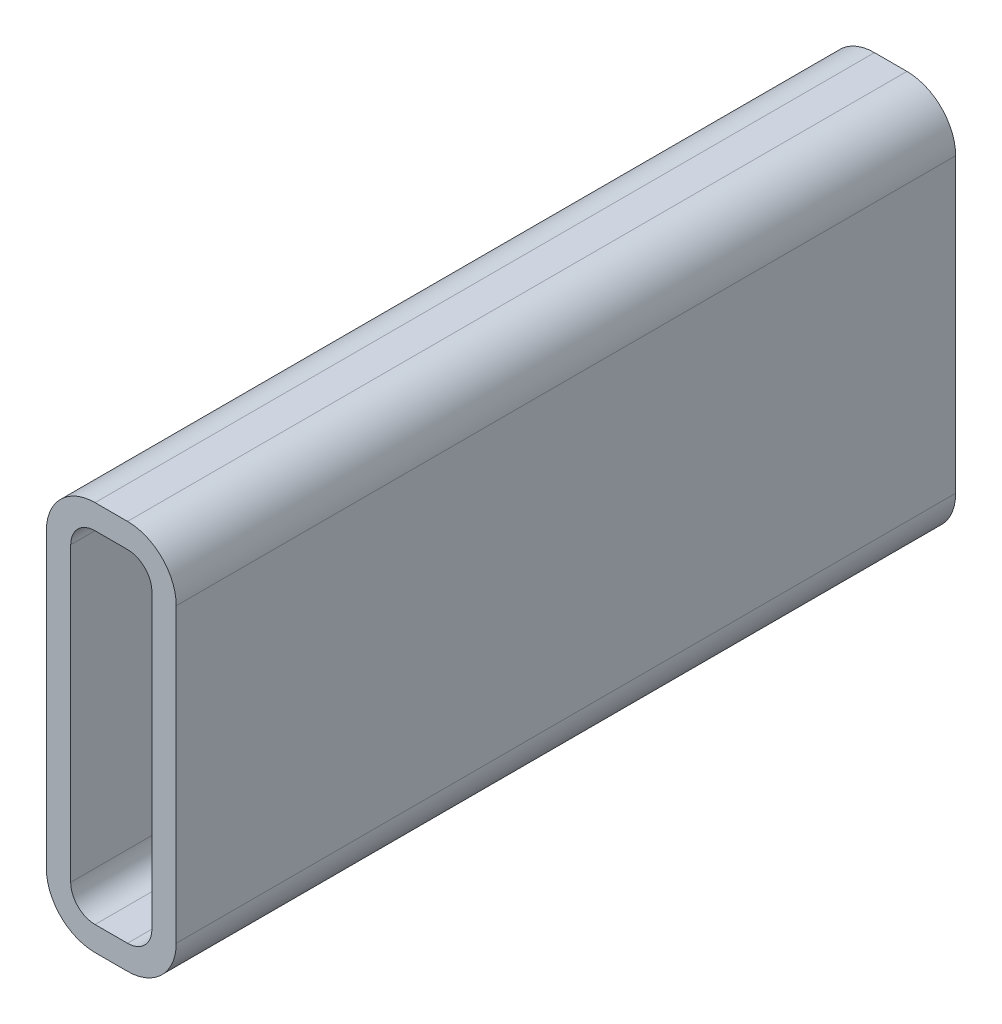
ISO-10303-21;
HEADER;
FILE_DESCRIPTION(('STEP AP214'),'2;1');
FILE_NAME('part.step','',(''),(''),'','','');
FILE_SCHEMA(('AUTOMOTIVE_DESIGN { 1 0 10303 214 1 1 1 1 }'));
ENDSEC;
DATA;
#1=APPLICATION_CONTEXT('core data for automotive mechanical design processes');
#2=APPLICATION_PROTOCOL_DEFINITION('international standard','automotive_design',2000,#1);
#3=PRODUCT_CONTEXT('',#1,'mechanical');
#4=PRODUCT('Part','Part','',(#3));
#5=PRODUCT_RELATED_PRODUCT_CATEGORY('part','',(#4));
#6=PRODUCT_DEFINITION_FORMATION('','',#4);
#7=PRODUCT_DEFINITION_CONTEXT('part definition',#1,'design');
#8=PRODUCT_DEFINITION('design','',#6,#7);
#9=PRODUCT_DEFINITION_SHAPE('','',#8);
#10=(LENGTH_UNIT() NAMED_UNIT(*) SI_UNIT(.MILLI.,.METRE.));
#11=(NAMED_UNIT(*) PLANE_ANGLE_UNIT() SI_UNIT($,.RADIAN.));
#12=(NAMED_UNIT(*) SI_UNIT($,.STERADIAN.) SOLID_ANGLE_UNIT());
#13=UNCERTAINTY_MEASURE_WITH_UNIT(LENGTH_MEASURE(1.E-05),#10,'distance_accuracy_value','');
#14=(GEOMETRIC_REPRESENTATION_CONTEXT(3) GLOBAL_UNCERTAINTY_ASSIGNED_CONTEXT((#13)) GLOBAL_UNIT_ASSIGNED_CONTEXT((#10,
#11,#12)) REPRESENTATION_CONTEXT('',''));
#15=CARTESIAN_POINT('',(0.,0.,0.));
#16=DIRECTION('',(0.,0.,1.));
#17=DIRECTION('',(1.,0.,0.));
#18=AXIS2_PLACEMENT_3D('',#15,#16,#17);
#19=CARTESIAN_POINT('',(19.05,133.35,304.8));
#20=DIRECTION('',(0.,0.,1.));
#21=DIRECTION('',(1.,0.,0.));
#22=AXIS2_PLACEMENT_3D('',#19,#20,#21);
#23=PLANE('',#22);
#24=CARTESIAN_POINT('',(19.05,133.35,304.8));
#25=DIRECTION('',(0.,0.,1.));
#26=DIRECTION('',(1.,0.,0.));
#27=AXIS2_PLACEMENT_3D('',#24,#25,#26);
#28=CIRCLE('',#27,19.05);
#29=CARTESIAN_POINT('',(19.05,152.4,304.8));
#30=VERTEX_POINT('',#29);
#31=CARTESIAN_POINT('',(0.,133.35,304.8));
#32=VERTEX_POINT('',#31);
#33=EDGE_CURVE('E211',#30,#32,#28,.T.);
#34=ORIENTED_EDGE('',*,*,#33,.T.);
#35=DIRECTION('',(0.,-1.,0.));
#36=VECTOR('',#35,1.);
#37=CARTESIAN_POINT('',(0.,19.05,304.8));
#38=LINE('',#37,#36);
#39=CARTESIAN_POINT('',(0.,19.05,304.8));
#40=VERTEX_POINT('',#39);
#41=EDGE_CURVE('E214',#32,#40,#38,.T.);
#42=ORIENTED_EDGE('',*,*,#41,.T.);
#43=CARTESIAN_POINT('',(19.05,19.05,304.8));
#44=DIRECTION('',(0.,0.,1.));
#45=DIRECTION('',(1.,0.,0.));
#46=AXIS2_PLACEMENT_3D('',#43,#44,#45);
#47=CIRCLE('',#46,19.05);
#48=CARTESIAN_POINT('',(19.05,0.,304.8));
#49=VERTEX_POINT('',#48);
#50=EDGE_CURVE('E217',#40,#49,#47,.T.);
#51=ORIENTED_EDGE('',*,*,#50,.T.);
#52=DIRECTION('',(1.,0.,0.));
#53=VECTOR('',#52,1.);
#54=CARTESIAN_POINT('',(31.75,0.,304.8));
#55=LINE('',#54,#53);
#56=CARTESIAN_POINT('',(31.75,0.,304.8));
#57=VERTEX_POINT('',#56);
#58=EDGE_CURVE('E219',#49,#57,#55,.T.);
#59=ORIENTED_EDGE('',*,*,#58,.T.);
#60=CARTESIAN_POINT('',(31.75,19.05,304.8));
#61=DIRECTION('',(0.,0.,1.));
#62=DIRECTION('',(1.,0.,0.));
#63=AXIS2_PLACEMENT_3D('',#60,#61,#62);
#64=CIRCLE('',#63,19.05);
#65=CARTESIAN_POINT('',(50.8,19.05,304.8));
#66=VERTEX_POINT('',#65);
#67=EDGE_CURVE('E221',#57,#66,#64,.T.);
#68=ORIENTED_EDGE('',*,*,#67,.T.);
#69=DIRECTION('',(0.,1.,0.));
#70=VECTOR('',#69,1.);
#71=CARTESIAN_POINT('',(50.8,133.35,304.8));
#72=LINE('',#71,#70);
#73=CARTESIAN_POINT('',(50.8,133.35,304.8));
#74=VERTEX_POINT('',#73);
#75=EDGE_CURVE('E223',#66,#74,#72,.T.);
#76=ORIENTED_EDGE('',*,*,#75,.T.);
#77=CARTESIAN_POINT('',(31.75,133.35,304.8));
#78=DIRECTION('',(0.,0.,1.));
#79=DIRECTION('',(1.,0.,0.));
#80=AXIS2_PLACEMENT_3D('',#77,#78,#79);
#81=CIRCLE('',#80,19.05);
#82=CARTESIAN_POINT('',(31.75,152.4,304.8));
#83=VERTEX_POINT('',#82);
#84=EDGE_CURVE('E225',#74,#83,#81,.T.);
#85=ORIENTED_EDGE('',*,*,#84,.T.);
#86=DIRECTION('',(-1.,0.,0.));
#87=VECTOR('',#86,1.);
#88=CARTESIAN_POINT('',(19.05,152.4,304.8));
#89=LINE('',#88,#87);
#90=EDGE_CURVE('E227',#83,#30,#89,.T.);
#91=ORIENTED_EDGE('',*,*,#90,.T.);
#92=EDGE_LOOP('',(#34,#42,#51,#59,#68,#76,#85,#91));
#93=FACE_BOUND('',#92,.T.);
#94=DIRECTION('',(0.,-1.,0.));
#95=VECTOR('',#94,1.);
#96=CARTESIAN_POINT('',(9.525,19.05,304.8));
#97=LINE('',#96,#95);
#98=CARTESIAN_POINT('',(9.525,133.35,304.8));
#99=VERTEX_POINT('',#98);
#100=CARTESIAN_POINT('',(9.525,19.05,304.8));
#101=VERTEX_POINT('',#100);
#102=EDGE_CURVE('E154',#99,#101,#97,.T.);
#103=ORIENTED_EDGE('',*,*,#102,.F.);
#104=CARTESIAN_POINT('',(19.05,133.35,304.8));
#105=DIRECTION('',(0.,0.,1.));
#106=DIRECTION('',(1.,0.,0.));
#107=AXIS2_PLACEMENT_3D('',#104,#105,#106);
#108=CIRCLE('',#107,9.525);
#109=CARTESIAN_POINT('',(19.05,142.875,304.8));
#110=VERTEX_POINT('',#109);
#111=EDGE_CURVE('E146',#110,#99,#108,.T.);
#112=ORIENTED_EDGE('',*,*,#111,.F.);
#113=DIRECTION('',(-1.,0.,0.));
#114=VECTOR('',#113,1.);
#115=CARTESIAN_POINT('',(19.05,142.875,304.8));
#116=LINE('',#115,#114);
#117=CARTESIAN_POINT('',(31.75,142.875,304.8));
#118=VERTEX_POINT('',#117);
#119=EDGE_CURVE('E179',#118,#110,#116,.T.);
#120=ORIENTED_EDGE('',*,*,#119,.F.);
#121=CARTESIAN_POINT('',(31.75,133.35,304.8));
#122=DIRECTION('',(0.,0.,1.));
#123=DIRECTION('',(1.,0.,0.));
#124=AXIS2_PLACEMENT_3D('',#121,#122,#123);
#125=CIRCLE('',#124,9.525);
#126=CARTESIAN_POINT('',(41.275,133.35,304.8));
#127=VERTEX_POINT('',#126);
#128=EDGE_CURVE('E177',#127,#118,#125,.T.);
#129=ORIENTED_EDGE('',*,*,#128,.F.);
#130=DIRECTION('',(0.,1.,0.));
#131=VECTOR('',#130,1.);
#132=CARTESIAN_POINT('',(41.275,133.35,304.8));
#133=LINE('',#132,#131);
#134=CARTESIAN_POINT('',(41.275,19.05,304.8));
#135=VERTEX_POINT('',#134);
#136=EDGE_CURVE('E175',#135,#127,#133,.T.);
#137=ORIENTED_EDGE('',*,*,#136,.F.);
#138=CARTESIAN_POINT('',(31.75,19.05,304.8));
#139=DIRECTION('',(0.,0.,1.));
#140=DIRECTION('',(1.,0.,0.));
#141=AXIS2_PLACEMENT_3D('',#138,#139,#140);
#142=CIRCLE('',#141,9.525);
#143=CARTESIAN_POINT('',(31.75,9.525,304.8));
#144=VERTEX_POINT('',#143);
#145=EDGE_CURVE('E173',#144,#135,#142,.T.);
#146=ORIENTED_EDGE('',*,*,#145,.F.);
#147=DIRECTION('',(1.,0.,0.));
#148=VECTOR('',#147,1.);
#149=CARTESIAN_POINT('',(31.75,9.525,304.8));
#150=LINE('',#149,#148);
#151=CARTESIAN_POINT('',(19.05,9.525,304.8));
#152=VERTEX_POINT('',#151);
#153=EDGE_CURVE('E169',#152,#144,#150,.T.);
#154=ORIENTED_EDGE('',*,*,#153,.F.);
#155=CARTESIAN_POINT('',(19.05,19.05,304.8));
#156=DIRECTION('',(0.,0.,1.));
#157=DIRECTION('',(1.,0.,0.));
#158=AXIS2_PLACEMENT_3D('',#155,#156,#157);
#159=CIRCLE('',#158,9.525);
#160=EDGE_CURVE('E167',#101,#152,#159,.T.);
#161=ORIENTED_EDGE('',*,*,#160,.F.);
#162=EDGE_LOOP('',(#103,#112,#120,#129,#137,#146,#154,#161));
#163=FACE_BOUND('',#162,.T.);
#164=ADVANCED_FACE('F33',(#93,#163),#23,.T.);
#165=CARTESIAN_POINT('',(19.05,133.35,0.));
#166=DIRECTION('',(0.,0.,1.));
#167=DIRECTION('',(1.,0.,0.));
#168=AXIS2_PLACEMENT_3D('',#165,#166,#167);
#169=PLANE('',#168);
#170=CARTESIAN_POINT('',(19.05,133.35,0.));
#171=DIRECTION('',(0.,0.,1.));
#172=DIRECTION('',(1.,0.,0.));
#173=AXIS2_PLACEMENT_3D('',#170,#171,#172);
#174=CIRCLE('',#173,19.05);
#175=CARTESIAN_POINT('',(19.05,152.4,0.));
#176=VERTEX_POINT('',#175);
#177=CARTESIAN_POINT('',(0.,133.35,0.));
#178=VERTEX_POINT('',#177);
#179=EDGE_CURVE('E162',#176,#178,#174,.T.);
#180=ORIENTED_EDGE('',*,*,#179,.F.);
#181=DIRECTION('',(-1.,0.,0.));
#182=VECTOR('',#181,1.);
#183=CARTESIAN_POINT('',(19.05,152.4,0.));
#184=LINE('',#183,#182);
#185=CARTESIAN_POINT('',(31.75,152.4,0.));
#186=VERTEX_POINT('',#185);
#187=EDGE_CURVE('E215',#186,#176,#184,.T.);
#188=ORIENTED_EDGE('',*,*,#187,.F.);
#189=CARTESIAN_POINT('',(31.75,133.35,0.));
#190=DIRECTION('',(0.,0.,1.));
#191=DIRECTION('',(1.,0.,0.));
#192=AXIS2_PLACEMENT_3D('',#189,#190,#191);
#193=CIRCLE('',#192,19.05);
#194=CARTESIAN_POINT('',(50.8,133.35,0.));
#195=VERTEX_POINT('',#194);
#196=EDGE_CURVE('E242',#195,#186,#193,.T.);
#197=ORIENTED_EDGE('',*,*,#196,.F.);
#198=DIRECTION('',(0.,1.,0.));
#199=VECTOR('',#198,1.);
#200=CARTESIAN_POINT('',(50.8,133.35,0.));
#201=LINE('',#200,#199);
#202=CARTESIAN_POINT('',(50.8,19.05,0.));
#203=VERTEX_POINT('',#202);
#204=EDGE_CURVE('E240',#203,#195,#201,.T.);
#205=ORIENTED_EDGE('',*,*,#204,.F.);
#206=CARTESIAN_POINT('',(31.75,19.05,0.));
#207=DIRECTION('',(0.,0.,1.));
#208=DIRECTION('',(1.,0.,0.));
#209=AXIS2_PLACEMENT_3D('',#206,#207,#208);
#210=CIRCLE('',#209,19.05);
#211=CARTESIAN_POINT('',(31.75,0.,0.));
#212=VERTEX_POINT('',#211);
#213=EDGE_CURVE('E238',#212,#203,#210,.T.);
#214=ORIENTED_EDGE('',*,*,#213,.F.);
#215=DIRECTION('',(1.,0.,0.));
#216=VECTOR('',#215,1.);
#217=CARTESIAN_POINT('',(31.75,0.,0.));
#218=LINE('',#217,#216);
#219=CARTESIAN_POINT('',(19.05,0.,0.));
#220=VERTEX_POINT('',#219);
#221=EDGE_CURVE('E236',#220,#212,#218,.T.);
#222=ORIENTED_EDGE('',*,*,#221,.F.);
#223=CARTESIAN_POINT('',(19.05,19.05,0.));
#224=DIRECTION('',(0.,0.,1.));
#225=DIRECTION('',(1.,0.,0.));
#226=AXIS2_PLACEMENT_3D('',#223,#224,#225);
#227=CIRCLE('',#226,19.05);
#228=CARTESIAN_POINT('',(0.,19.05,0.));
#229=VERTEX_POINT('',#228);
#230=EDGE_CURVE('E234',#229,#220,#227,.T.);
#231=ORIENTED_EDGE('',*,*,#230,.F.);
#232=DIRECTION('',(0.,-1.,0.));
#233=VECTOR('',#232,1.);
#234=CARTESIAN_POINT('',(0.,19.05,0.));
#235=LINE('',#234,#233);
#236=EDGE_CURVE('E232',#178,#229,#235,.T.);
#237=ORIENTED_EDGE('',*,*,#236,.F.);
#238=EDGE_LOOP('',(#180,#188,#197,#205,#214,#222,#231,#237));
#239=FACE_BOUND('',#238,.T.);
#240=CARTESIAN_POINT('',(19.05,133.35,0.));
#241=DIRECTION('',(0.,0.,1.));
#242=DIRECTION('',(1.,0.,0.));
#243=AXIS2_PLACEMENT_3D('',#240,#241,#242);
#244=CIRCLE('',#243,9.525);
#245=CARTESIAN_POINT('',(19.05,142.875,0.));
#246=VERTEX_POINT('',#245);
#247=CARTESIAN_POINT('',(9.525,133.35,0.));
#248=VERTEX_POINT('',#247);
#249=EDGE_CURVE('E56',#246,#248,#244,.T.);
#250=ORIENTED_EDGE('',*,*,#249,.T.);
#251=DIRECTION('',(0.,-1.,0.));
#252=VECTOR('',#251,1.);
#253=CARTESIAN_POINT('',(9.525,19.05,0.));
#254=LINE('',#253,#252);
#255=CARTESIAN_POINT('',(9.525,19.05,0.));
#256=VERTEX_POINT('',#255);
#257=EDGE_CURVE('E161',#248,#256,#254,.T.);
#258=ORIENTED_EDGE('',*,*,#257,.T.);
#259=CARTESIAN_POINT('',(19.05,19.05,0.));
#260=DIRECTION('',(0.,0.,1.));
#261=DIRECTION('',(1.,0.,0.));
#262=AXIS2_PLACEMENT_3D('',#259,#260,#261);
#263=CIRCLE('',#262,9.525);
#264=CARTESIAN_POINT('',(19.05,9.525,0.));
#265=VERTEX_POINT('',#264);
#266=EDGE_CURVE('E183',#256,#265,#263,.T.);
#267=ORIENTED_EDGE('',*,*,#266,.T.);
#268=DIRECTION('',(1.,0.,0.));
#269=VECTOR('',#268,1.);
#270=CARTESIAN_POINT('',(31.75,9.525,0.));
#271=LINE('',#270,#269);
#272=CARTESIAN_POINT('',(31.75,9.525,0.));
#273=VERTEX_POINT('',#272);
#274=EDGE_CURVE('E186',#265,#273,#271,.T.);
#275=ORIENTED_EDGE('',*,*,#274,.T.);
#276=CARTESIAN_POINT('',(31.75,19.05,0.));
#277=DIRECTION('',(0.,0.,1.));
#278=DIRECTION('',(1.,0.,0.));
#279=AXIS2_PLACEMENT_3D('',#276,#277,#278);
#280=CIRCLE('',#279,9.525);
#281=CARTESIAN_POINT('',(41.275,19.05,0.));
#282=VERTEX_POINT('',#281);
#283=EDGE_CURVE('E189',#273,#282,#280,.T.);
#284=ORIENTED_EDGE('',*,*,#283,.T.);
#285=DIRECTION('',(0.,1.,0.));
#286=VECTOR('',#285,1.);
#287=CARTESIAN_POINT('',(41.275,133.35,0.));
#288=LINE('',#287,#286);
#289=CARTESIAN_POINT('',(41.275,133.35,0.));
#290=VERTEX_POINT('',#289);
#291=EDGE_CURVE('E192',#282,#290,#288,.T.);
#292=ORIENTED_EDGE('',*,*,#291,.T.);
#293=CARTESIAN_POINT('',(31.75,133.35,0.));
#294=DIRECTION('',(0.,0.,1.));
#295=DIRECTION('',(1.,0.,0.));
#296=AXIS2_PLACEMENT_3D('',#293,#294,#295);
#297=CIRCLE('',#296,9.525);
#298=CARTESIAN_POINT('',(31.75,142.875,0.));
#299=VERTEX_POINT('',#298);
#300=EDGE_CURVE('E195',#290,#299,#297,.T.);
#301=ORIENTED_EDGE('',*,*,#300,.T.);
#302=DIRECTION('',(-1.,0.,0.));
#303=VECTOR('',#302,1.);
#304=CARTESIAN_POINT('',(19.05,142.875,0.));
#305=LINE('',#304,#303);
#306=EDGE_CURVE('E155',#299,#246,#305,.T.);
#307=ORIENTED_EDGE('',*,*,#306,.T.);
#308=EDGE_LOOP('',(#250,#258,#267,#275,#284,#292,#301,#307));
#309=FACE_BOUND('',#308,.T.);
#310=ADVANCED_FACE('F272',(#239,#309),#169,.F.);
#311=CARTESIAN_POINT('',(19.05,133.35,304.8));
#312=DIRECTION('',(0.,0.,-1.));
#313=DIRECTION('',(-1.,0.,0.));
#314=AXIS2_PLACEMENT_3D('',#311,#312,#313);
#315=CYLINDRICAL_SURFACE('',#314,19.05);
#316=ORIENTED_EDGE('',*,*,#179,.T.);
#317=DIRECTION('',(0.,0.,-1.));
#318=VECTOR('',#317,1.);
#319=CARTESIAN_POINT('',(0.,133.35,304.8));
#320=LINE('',#319,#318);
#321=EDGE_CURVE('E11',#32,#178,#320,.T.);
#322=ORIENTED_EDGE('',*,*,#321,.F.);
#323=ORIENTED_EDGE('',*,*,#33,.F.);
#324=DIRECTION('',(0.,0.,-1.));
#325=VECTOR('',#324,1.);
#326=CARTESIAN_POINT('',(19.05,152.4,304.8));
#327=LINE('',#326,#325);
#328=EDGE_CURVE('E229',#30,#176,#327,.T.);
#329=ORIENTED_EDGE('',*,*,#328,.T.);
#330=EDGE_LOOP('',(#316,#322,#323,#329));
#331=FACE_BOUND('',#330,.T.);
#332=ADVANCED_FACE('F35',(#331),#315,.T.);
#333=CARTESIAN_POINT('',(0.,19.05,304.8));
#334=DIRECTION('',(1.,0.,0.));
#335=DIRECTION('',(0.,0.,-1.));
#336=AXIS2_PLACEMENT_3D('',#333,#334,#335);
#337=PLANE('',#336);
#338=ORIENTED_EDGE('',*,*,#236,.T.);
#339=DIRECTION('',(0.,0.,-1.));
#340=VECTOR('',#339,1.);
#341=CARTESIAN_POINT('',(0.,19.05,304.8));
#342=LINE('',#341,#340);
#343=EDGE_CURVE('E41',#40,#229,#342,.T.);
#344=ORIENTED_EDGE('',*,*,#343,.F.);
#345=ORIENTED_EDGE('',*,*,#41,.F.);
#346=ORIENTED_EDGE('',*,*,#321,.T.);
#347=EDGE_LOOP('',(#338,#344,#345,#346));
#348=FACE_BOUND('',#347,.T.);
#349=ADVANCED_FACE('F289',(#348),#337,.F.);
#350=CARTESIAN_POINT('',(19.05,19.05,304.8));
#351=DIRECTION('',(0.,0.,-1.));
#352=DIRECTION('',(-1.,0.,0.));
#353=AXIS2_PLACEMENT_3D('',#350,#351,#352);
#354=CYLINDRICAL_SURFACE('',#353,19.05);
#355=ORIENTED_EDGE('',*,*,#230,.T.);
#356=DIRECTION('',(0.,0.,-1.));
#357=VECTOR('',#356,1.);
#358=CARTESIAN_POINT('',(19.05,0.,304.8));
#359=LINE('',#358,#357);
#360=EDGE_CURVE('E259',#49,#220,#359,.T.);
#361=ORIENTED_EDGE('',*,*,#360,.F.);
#362=ORIENTED_EDGE('',*,*,#50,.F.);
#363=ORIENTED_EDGE('',*,*,#343,.T.);
#364=EDGE_LOOP('',(#355,#361,#362,#363));
#365=FACE_BOUND('',#364,.T.);
#366=ADVANCED_FACE('F266',(#365),#354,.T.);
#367=CARTESIAN_POINT('',(31.75,0.,304.8));
#368=DIRECTION('',(0.,1.,0.));
#369=DIRECTION('',(0.,0.,1.));
#370=AXIS2_PLACEMENT_3D('',#367,#368,#369);
#371=PLANE('',#370);
#372=ORIENTED_EDGE('',*,*,#221,.T.);
#373=DIRECTION('',(0.,0.,-1.));
#374=VECTOR('',#373,1.);
#375=CARTESIAN_POINT('',(31.75,0.,304.8));
#376=LINE('',#375,#374);
#377=EDGE_CURVE('E256',#57,#212,#376,.T.);
#378=ORIENTED_EDGE('',*,*,#377,.F.);
#379=ORIENTED_EDGE('',*,*,#58,.F.);
#380=ORIENTED_EDGE('',*,*,#360,.T.);
#381=EDGE_LOOP('',(#372,#378,#379,#380));
#382=FACE_BOUND('',#381,.T.);
#383=ADVANCED_FACE('F278',(#382),#371,.F.);
#384=CARTESIAN_POINT('',(31.75,19.05,304.8));
#385=DIRECTION('',(0.,0.,-1.));
#386=DIRECTION('',(-1.,0.,0.));
#387=AXIS2_PLACEMENT_3D('',#384,#385,#386);
#388=CYLINDRICAL_SURFACE('',#387,19.05);
#389=ORIENTED_EDGE('',*,*,#213,.T.);
#390=DIRECTION('',(0.,0.,-1.));
#391=VECTOR('',#390,1.);
#392=CARTESIAN_POINT('',(50.8,19.05,304.8));
#393=LINE('',#392,#391);
#394=EDGE_CURVE('E253',#66,#203,#393,.T.);
#395=ORIENTED_EDGE('',*,*,#394,.F.);
#396=ORIENTED_EDGE('',*,*,#67,.F.);
#397=ORIENTED_EDGE('',*,*,#377,.T.);
#398=EDGE_LOOP('',(#389,#395,#396,#397));
#399=FACE_BOUND('',#398,.T.);
#400=ADVANCED_FACE('F282',(#399),#388,.T.);
#401=CARTESIAN_POINT('',(50.8,133.35,304.8));
#402=DIRECTION('',(-1.,0.,0.));
#403=DIRECTION('',(0.,0.,1.));
#404=AXIS2_PLACEMENT_3D('',#401,#402,#403);
#405=PLANE('',#404);
#406=ORIENTED_EDGE('',*,*,#204,.T.);
#407=DIRECTION('',(0.,0.,-1.));
#408=VECTOR('',#407,1.);
#409=CARTESIAN_POINT('',(50.8,133.35,304.8));
#410=LINE('',#409,#408);
#411=EDGE_CURVE('E250',#74,#195,#410,.T.);
#412=ORIENTED_EDGE('',*,*,#411,.F.);
#413=ORIENTED_EDGE('',*,*,#75,.F.);
#414=ORIENTED_EDGE('',*,*,#394,.T.);
#415=EDGE_LOOP('',(#406,#412,#413,#414));
#416=FACE_BOUND('',#415,.T.);
#417=ADVANCED_FACE('F302',(#416),#405,.F.);
#418=CARTESIAN_POINT('',(31.75,133.35,304.8));
#419=DIRECTION('',(0.,0.,-1.));
#420=DIRECTION('',(-1.,0.,0.));
#421=AXIS2_PLACEMENT_3D('',#418,#419,#420);
#422=CYLINDRICAL_SURFACE('',#421,19.05);
#423=ORIENTED_EDGE('',*,*,#196,.T.);
#424=DIRECTION('',(0.,0.,-1.));
#425=VECTOR('',#424,1.);
#426=CARTESIAN_POINT('',(31.75,152.4,304.8));
#427=LINE('',#426,#425);
#428=EDGE_CURVE('E247',#83,#186,#427,.T.);
#429=ORIENTED_EDGE('',*,*,#428,.F.);
#430=ORIENTED_EDGE('',*,*,#84,.F.);
#431=ORIENTED_EDGE('',*,*,#411,.T.);
#432=EDGE_LOOP('',(#423,#429,#430,#431));
#433=FACE_BOUND('',#432,.T.);
#434=ADVANCED_FACE('F300',(#433),#422,.T.);
#435=CARTESIAN_POINT('',(19.05,152.4,304.8));
#436=DIRECTION('',(0.,-1.,0.));
#437=DIRECTION('',(0.,0.,-1.));
#438=AXIS2_PLACEMENT_3D('',#435,#436,#437);
#439=PLANE('',#438);
#440=ORIENTED_EDGE('',*,*,#187,.T.);
#441=ORIENTED_EDGE('',*,*,#328,.F.);
#442=ORIENTED_EDGE('',*,*,#90,.F.);
#443=ORIENTED_EDGE('',*,*,#428,.T.);
#444=EDGE_LOOP('',(#440,#441,#442,#443));
#445=FACE_BOUND('',#444,.T.);
#446=ADVANCED_FACE('F295',(#445),#439,.F.);
#447=CARTESIAN_POINT('',(19.05,133.35,304.8));
#448=DIRECTION('',(0.,0.,-1.));
#449=DIRECTION('',(-1.,0.,0.));
#450=AXIS2_PLACEMENT_3D('',#447,#448,#449);
#451=CYLINDRICAL_SURFACE('',#450,9.525);
#452=ORIENTED_EDGE('',*,*,#249,.F.);
#453=DIRECTION('',(0.,0.,-1.));
#454=VECTOR('',#453,1.);
#455=CARTESIAN_POINT('',(19.05,142.875,304.8));
#456=LINE('',#455,#454);
#457=EDGE_CURVE('E150',#110,#246,#456,.T.);
#458=ORIENTED_EDGE('',*,*,#457,.F.);
#459=ORIENTED_EDGE('',*,*,#111,.T.);
#460=DIRECTION('',(0.,0.,-1.));
#461=VECTOR('',#460,1.);
#462=CARTESIAN_POINT('',(9.525,133.35,304.8));
#463=LINE('',#462,#461);
#464=EDGE_CURVE('E149',#99,#248,#463,.T.);
#465=ORIENTED_EDGE('',*,*,#464,.T.);
#466=EDGE_LOOP('',(#452,#458,#459,#465));
#467=FACE_BOUND('',#466,.T.);
#468=ADVANCED_FACE('F148',(#467),#451,.F.);
#469=CARTESIAN_POINT('',(9.525,19.05,304.8));
#470=DIRECTION('',(1.,0.,0.));
#471=DIRECTION('',(0.,0.,-1.));
#472=AXIS2_PLACEMENT_3D('',#469,#470,#471);
#473=PLANE('',#472);
#474=ORIENTED_EDGE('',*,*,#257,.F.);
#475=ORIENTED_EDGE('',*,*,#464,.F.);
#476=ORIENTED_EDGE('',*,*,#102,.T.);
#477=DIRECTION('',(0.,0.,-1.));
#478=VECTOR('',#477,1.);
#479=CARTESIAN_POINT('',(9.525,19.05,304.8));
#480=LINE('',#479,#478);
#481=EDGE_CURVE('E163',#101,#256,#480,.T.);
#482=ORIENTED_EDGE('',*,*,#481,.T.);
#483=EDGE_LOOP('',(#474,#475,#476,#482));
#484=FACE_BOUND('',#483,.T.);
#485=ADVANCED_FACE('F158',(#484),#473,.T.);
#486=CARTESIAN_POINT('',(19.05,19.05,304.8));
#487=DIRECTION('',(0.,0.,-1.));
#488=DIRECTION('',(-1.,0.,0.));
#489=AXIS2_PLACEMENT_3D('',#486,#487,#488);
#490=CYLINDRICAL_SURFACE('',#489,9.525);
#491=ORIENTED_EDGE('',*,*,#266,.F.);
#492=ORIENTED_EDGE('',*,*,#481,.F.);
#493=ORIENTED_EDGE('',*,*,#160,.T.);
#494=DIRECTION('',(0.,0.,-1.));
#495=VECTOR('',#494,1.);
#496=CARTESIAN_POINT('',(19.05,9.525,304.8));
#497=LINE('',#496,#495);
#498=EDGE_CURVE('E208',#152,#265,#497,.T.);
#499=ORIENTED_EDGE('',*,*,#498,.T.);
#500=EDGE_LOOP('',(#491,#492,#493,#499));
#501=FACE_BOUND('',#500,.T.);
#502=ADVANCED_FACE('F327',(#501),#490,.F.);
#503=CARTESIAN_POINT('',(31.75,9.525,304.8));
#504=DIRECTION('',(0.,1.,0.));
#505=DIRECTION('',(0.,0.,1.));
#506=AXIS2_PLACEMENT_3D('',#503,#504,#505);
#507=PLANE('',#506);
#508=ORIENTED_EDGE('',*,*,#274,.F.);
#509=ORIENTED_EDGE('',*,*,#498,.F.);
#510=ORIENTED_EDGE('',*,*,#153,.T.);
#511=DIRECTION('',(0.,0.,-1.));
#512=VECTOR('',#511,1.);
#513=CARTESIAN_POINT('',(31.75,9.525,304.8));
#514=LINE('',#513,#512);
#515=EDGE_CURVE('E206',#144,#273,#514,.T.);
#516=ORIENTED_EDGE('',*,*,#515,.T.);
#517=EDGE_LOOP('',(#508,#509,#510,#516));
#518=FACE_BOUND('',#517,.T.);
#519=ADVANCED_FACE('F331',(#518),#507,.T.);
#520=CARTESIAN_POINT('',(31.75,19.05,304.8));
#521=DIRECTION('',(0.,0.,-1.));
#522=DIRECTION('',(-1.,0.,0.));
#523=AXIS2_PLACEMENT_3D('',#520,#521,#522);
#524=CYLINDRICAL_SURFACE('',#523,9.525);
#525=ORIENTED_EDGE('',*,*,#283,.F.);
#526=ORIENTED_EDGE('',*,*,#515,.F.);
#527=ORIENTED_EDGE('',*,*,#145,.T.);
#528=DIRECTION('',(0.,0.,-1.));
#529=VECTOR('',#528,1.);
#530=CARTESIAN_POINT('',(41.275,19.05,304.8));
#531=LINE('',#530,#529);
#532=EDGE_CURVE('E204',#135,#282,#531,.T.);
#533=ORIENTED_EDGE('',*,*,#532,.T.);
#534=EDGE_LOOP('',(#525,#526,#527,#533));
#535=FACE_BOUND('',#534,.T.);
#536=ADVANCED_FACE('F337',(#535),#524,.F.);
#537=CARTESIAN_POINT('',(41.275,133.35,304.8));
#538=DIRECTION('',(-1.,0.,0.));
#539=DIRECTION('',(0.,0.,1.));
#540=AXIS2_PLACEMENT_3D('',#537,#538,#539);
#541=PLANE('',#540);
#542=ORIENTED_EDGE('',*,*,#291,.F.);
#543=ORIENTED_EDGE('',*,*,#532,.F.);
#544=ORIENTED_EDGE('',*,*,#136,.T.);
#545=DIRECTION('',(0.,0.,-1.));
#546=VECTOR('',#545,1.);
#547=CARTESIAN_POINT('',(41.275,133.35,304.8));
#548=LINE('',#547,#546);
#549=EDGE_CURVE('E202',#127,#290,#548,.T.);
#550=ORIENTED_EDGE('',*,*,#549,.T.);
#551=EDGE_LOOP('',(#542,#543,#544,#550));
#552=FACE_BOUND('',#551,.T.);
#553=ADVANCED_FACE('F341',(#552),#541,.T.);
#554=CARTESIAN_POINT('',(31.75,133.35,304.8));
#555=DIRECTION('',(0.,0.,-1.));
#556=DIRECTION('',(-1.,0.,0.));
#557=AXIS2_PLACEMENT_3D('',#554,#555,#556);
#558=CYLINDRICAL_SURFACE('',#557,9.525);
#559=ORIENTED_EDGE('',*,*,#300,.F.);
#560=ORIENTED_EDGE('',*,*,#549,.F.);
#561=ORIENTED_EDGE('',*,*,#128,.T.);
#562=DIRECTION('',(0.,0.,-1.));
#563=VECTOR('',#562,1.);
#564=CARTESIAN_POINT('',(31.75,142.875,304.8));
#565=LINE('',#564,#563);
#566=EDGE_CURVE('E48',#118,#299,#565,.T.);
#567=ORIENTED_EDGE('',*,*,#566,.T.);
#568=EDGE_LOOP('',(#559,#560,#561,#567));
#569=FACE_BOUND('',#568,.T.);
#570=ADVANCED_FACE('F345',(#569),#558,.F.);
#571=CARTESIAN_POINT('',(19.05,142.875,304.8));
#572=DIRECTION('',(0.,-1.,0.));
#573=DIRECTION('',(0.,0.,-1.));
#574=AXIS2_PLACEMENT_3D('',#571,#572,#573);
#575=PLANE('',#574);
#576=ORIENTED_EDGE('',*,*,#306,.F.);
#577=ORIENTED_EDGE('',*,*,#566,.F.);
#578=ORIENTED_EDGE('',*,*,#119,.T.);
#579=ORIENTED_EDGE('',*,*,#457,.T.);
#580=EDGE_LOOP('',(#576,#577,#578,#579));
#581=FACE_BOUND('',#580,.T.);
#582=ADVANCED_FACE('F349',(#581),#575,.T.);
#583=CLOSED_SHELL('',(#164,#310,#332,#349,#366,#383,#400,#417,#434,#446,#468,#485,#502,#519,
#536,#553,#570,#582));
#584=MANIFOLD_SOLID_BREP('B2',#583);
#585=ADVANCED_BREP_SHAPE_REPRESENTATION('',(#18,#584),#14);
#586=SHAPE_DEFINITION_REPRESENTATION(#9,#585);
ENDSEC;
END-ISO-10303-21;
